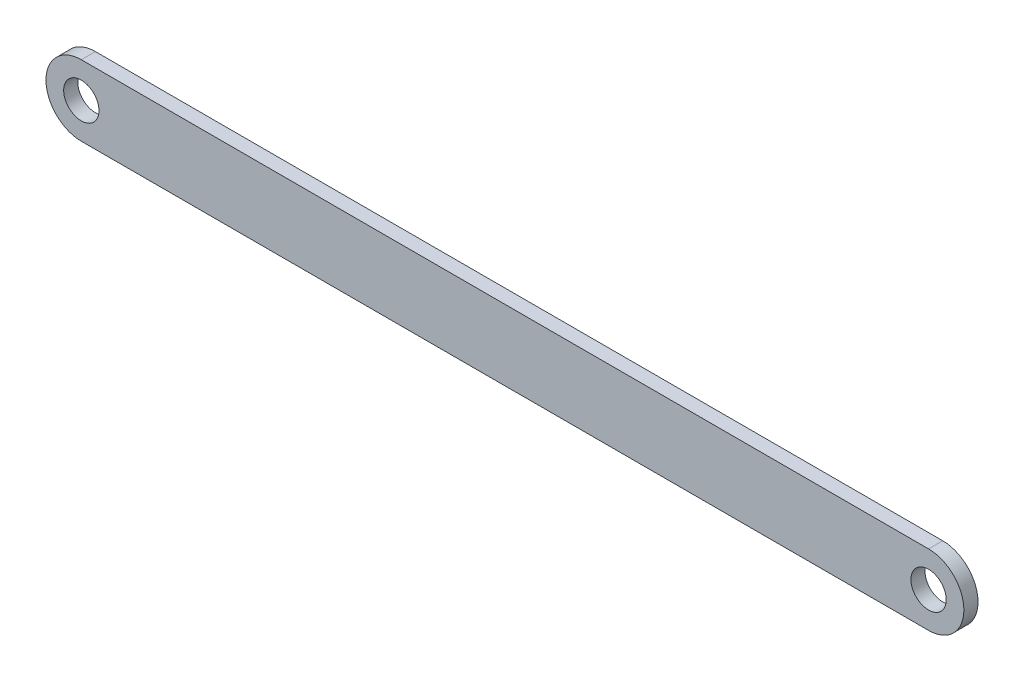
from build123d import *

# Parameters (mm, degrees)
SKETCH1_R           = 2.5
BOSS_EXTRUDE1_DEPTH = 1


with BuildPart() as part:
    # Sketch1 → Boss-Extrude1 (new, symmetric)
    with BuildSketch(Plane.XY):
        with BuildLine():
            Line((-60, 5), (60, 5))
            ThreePointArc((60, 5), (65, 0), (60, -5))
            Line((60, -5), (-60, -5))
            ThreePointArc((-60, -5), (-65, 0), (-60, 5))
        make_face()
        with Locations((-60, 0)):
            Circle(SKETCH1_R, mode=Mode.SUBTRACT)
        with Locations((60, 0)):
            Circle(SKETCH1_R, mode=Mode.SUBTRACT)
    extrude(amount=BOSS_EXTRUDE1_DEPTH, both=True)


solid = part.part
